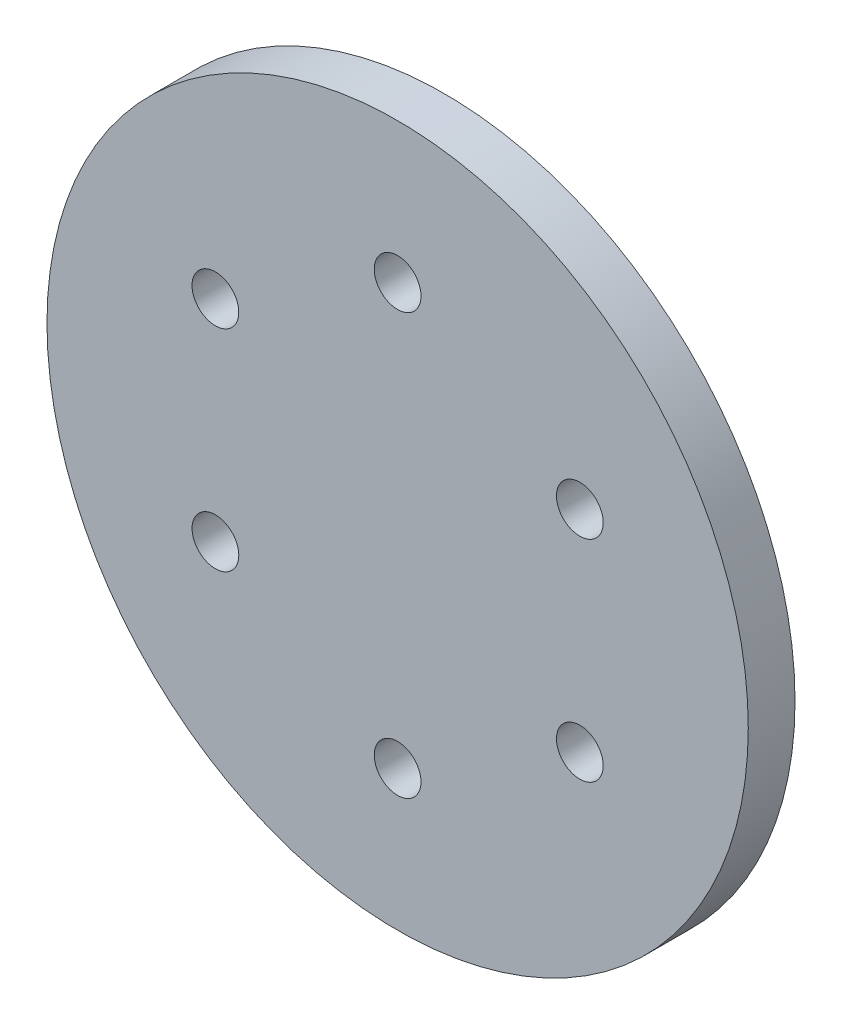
from build123d import *

# Parameters (mm, degrees)
SKETCH1_R           = 75
BOSS_EXTRUDE1_DEPTH = 10
SKETCH2_R           = 5
CUT_EXTRUDE1_DEPTH  = 107.536378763
CIRPATTERN1_COUNT   = 6


with BuildPart() as part:
    # Sketch1 → Boss-Extrude1 (new body)
    with BuildSketch(Plane.XY):
        Circle(SKETCH1_R)
    extrude(amount=BOSS_EXTRUDE1_DEPTH)

    # Sketch2 → Cut-Extrude1 (cut, through all)
    with BuildSketch(Plane.XY.offset(10)):
        with Locations((0, 45)):
            Circle(SKETCH2_R)
    cut_extrude1 = extrude(amount=-CUT_EXTRUDE1_DEPTH, mode=Mode.SUBTRACT)

    # CirPattern1: Cut-Extrude1 ×6 about axis
    cirpattern1_axis = Axis((0, 0, 0), (0, 0, 1))
    for i in range(1, CIRPATTERN1_COUNT):
        add(cut_extrude1.rotate(cirpattern1_axis, i * 360 / CIRPATTERN1_COUNT), mode=Mode.SUBTRACT)


solid = part.part
